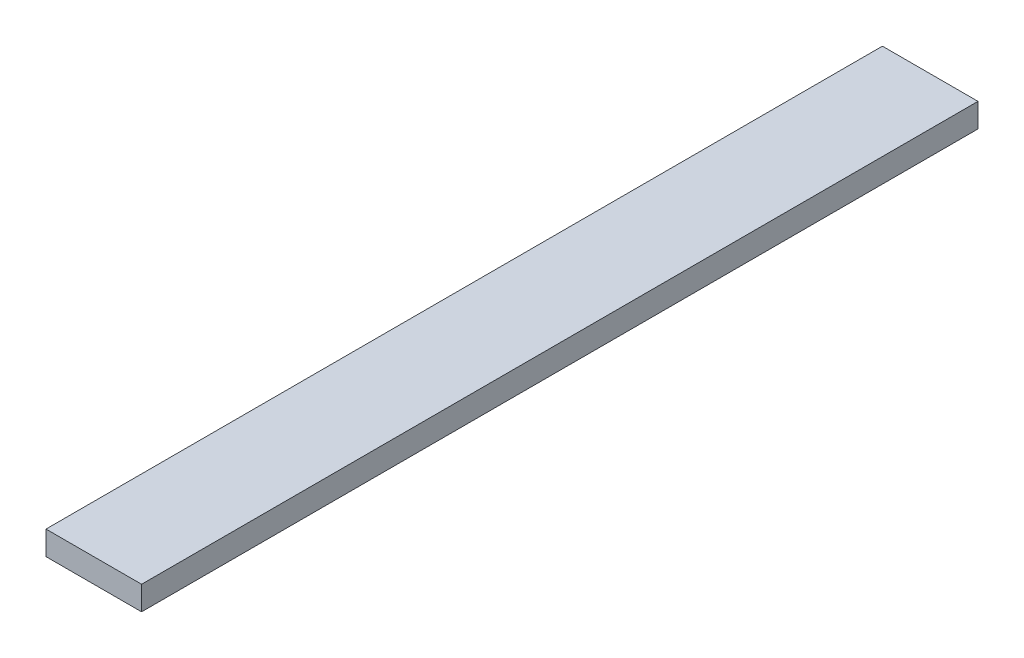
from build123d import *

# Parameters (mm, degrees)
SKETCH1_W           = 50.8
SKETCH1_H           = 12.7
BOSS_EXTRUDE1_DEPTH = 444.5


with BuildPart() as part:
    # Sketch1 → Boss-Extrude1 (new body)
    with BuildSketch(Plane.XY):
        Rectangle(SKETCH1_W, SKETCH1_H)
    extrude(amount=BOSS_EXTRUDE1_DEPTH)


solid = part.part
